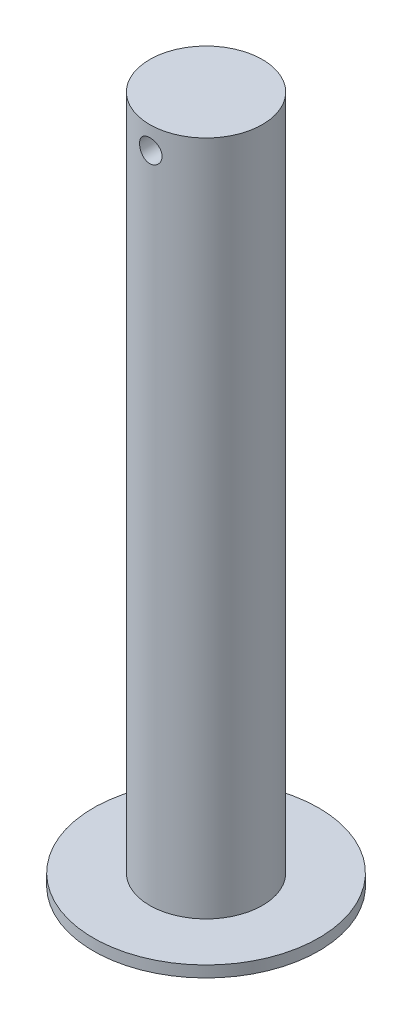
ISO-10303-21;
HEADER;
FILE_DESCRIPTION(('STEP AP214'),'2;1');
FILE_NAME('part.step','',(''),(''),'','','');
FILE_SCHEMA(('AUTOMOTIVE_DESIGN { 1 0 10303 214 1 1 1 1 }'));
ENDSEC;
DATA;
#1=APPLICATION_CONTEXT('core data for automotive mechanical design processes');
#2=APPLICATION_PROTOCOL_DEFINITION('international standard','automotive_design',2000,#1);
#3=PRODUCT_CONTEXT('',#1,'mechanical');
#4=PRODUCT('Part','Part','',(#3));
#5=PRODUCT_RELATED_PRODUCT_CATEGORY('part','',(#4));
#6=PRODUCT_DEFINITION_FORMATION('','',#4);
#7=PRODUCT_DEFINITION_CONTEXT('part definition',#1,'design');
#8=PRODUCT_DEFINITION('design','',#6,#7);
#9=PRODUCT_DEFINITION_SHAPE('','',#8);
#10=(LENGTH_UNIT() NAMED_UNIT(*) SI_UNIT(.MILLI.,.METRE.));
#11=(NAMED_UNIT(*) PLANE_ANGLE_UNIT() SI_UNIT($,.RADIAN.));
#12=(NAMED_UNIT(*) SI_UNIT($,.STERADIAN.) SOLID_ANGLE_UNIT());
#13=UNCERTAINTY_MEASURE_WITH_UNIT(LENGTH_MEASURE(1.E-05),#10,'distance_accuracy_value','');
#14=(GEOMETRIC_REPRESENTATION_CONTEXT(3) GLOBAL_UNCERTAINTY_ASSIGNED_CONTEXT((#13)) GLOBAL_UNIT_ASSIGNED_CONTEXT((#10,
#11,#12)) REPRESENTATION_CONTEXT('',''));
#15=CARTESIAN_POINT('',(0.,0.,0.));
#16=DIRECTION('',(0.,0.,1.));
#17=DIRECTION('',(1.,0.,0.));
#18=AXIS2_PLACEMENT_3D('',#15,#16,#17);
#19=CARTESIAN_POINT('',(0.,-1.27,0.));
#20=DIRECTION('',(0.,-1.,0.));
#21=DIRECTION('',(0.,0.,-1.));
#22=AXIS2_PLACEMENT_3D('',#19,#20,#21);
#23=CONICAL_SURFACE('',#22,10.31875,0.785398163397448);
#24=CARTESIAN_POINT('',(0.,0.,0.));
#25=DIRECTION('',(0.,1.,0.));
#26=DIRECTION('',(0.,0.,1.));
#27=AXIS2_PLACEMENT_3D('',#24,#25,#26);
#28=CIRCLE('',#27,9.04875000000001);
#29=CARTESIAN_POINT('',(0.,0.,9.04875000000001));
#30=VERTEX_POINT('',#29);
#31=EDGE_CURVE('E45',#30,#30,#28,.F.);
#32=ORIENTED_EDGE('',*,*,#31,.F.);
#33=EDGE_LOOP('',(#32));
#34=FACE_BOUND('',#33,.T.);
#35=CARTESIAN_POINT('',(0.,-1.27,0.));
#36=DIRECTION('',(0.,-1.,0.));
#37=DIRECTION('',(0.,0.,-1.));
#38=AXIS2_PLACEMENT_3D('',#35,#36,#37);
#39=CIRCLE('',#38,10.31875);
#40=CARTESIAN_POINT('',(0.,-1.27,-10.31875));
#41=VERTEX_POINT('',#40);
#42=EDGE_CURVE('E11',#41,#41,#39,.T.);
#43=ORIENTED_EDGE('',*,*,#42,.T.);
#44=EDGE_LOOP('',(#43));
#45=FACE_BOUND('',#44,.T.);
#46=ADVANCED_FACE('F39',(#34,#45),#23,.F.);
#47=CARTESIAN_POINT('',(0.,-2.54,0.));
#48=DIRECTION('',(0.,1.,0.));
#49=DIRECTION('',(0.,0.,1.));
#50=AXIS2_PLACEMENT_3D('',#47,#48,#49);
#51=CYLINDRICAL_SURFACE('',#50,10.31875);
#52=CARTESIAN_POINT('',(0.,0.,0.));
#53=DIRECTION('',(0.,1.,0.));
#54=DIRECTION('',(0.,0.,1.));
#55=AXIS2_PLACEMENT_3D('',#52,#53,#54);
#56=CIRCLE('',#55,10.31875);
#57=CARTESIAN_POINT('',(0.,0.,10.31875));
#58=VERTEX_POINT('',#57);
#59=EDGE_CURVE('E49',#58,#58,#56,.T.);
#60=ORIENTED_EDGE('',*,*,#59,.F.);
#61=EDGE_LOOP('',(#60));
#62=FACE_BOUND('',#61,.T.);
#63=ORIENTED_EDGE('',*,*,#42,.F.);
#64=EDGE_LOOP('',(#63));
#65=FACE_BOUND('',#64,.T.);
#66=ADVANCED_FACE('F58',(#62,#65),#51,.T.);
#67=CARTESIAN_POINT('',(0.,0.,0.));
#68=DIRECTION('',(0.,1.,0.));
#69=DIRECTION('',(0.,0.,1.));
#70=AXIS2_PLACEMENT_3D('',#67,#68,#69);
#71=PLANE('',#70);
#72=ORIENTED_EDGE('',*,*,#59,.T.);
#73=EDGE_LOOP('',(#72));
#74=FACE_BOUND('',#73,.T.);
#75=ORIENTED_EDGE('',*,*,#31,.T.);
#76=EDGE_LOOP('',(#75));
#77=FACE_BOUND('',#76,.T.);
#78=ADVANCED_FACE('F56',(#74,#77),#71,.T.);
#79=CLOSED_SHELL('',(#46,#66,#78));
#80=MANIFOLD_SOLID_BREP('B2',#79);
#81=CARTESIAN_POINT('',(0.,-2.54,0.));
#82=DIRECTION('',(0.,-1.,0.));
#83=DIRECTION('',(0.,0.,-1.));
#84=AXIS2_PLACEMENT_3D('',#81,#82,#83);
#85=PLANE('',#84);
#86=CARTESIAN_POINT('',(0.,-2.54,0.));
#87=DIRECTION('',(0.,-1.,0.));
#88=DIRECTION('',(0.,0.,-1.));
#89=AXIS2_PLACEMENT_3D('',#86,#87,#88);
#90=CIRCLE('',#89,25.4);
#91=CARTESIAN_POINT('',(0.,-2.54,-25.4));
#92=VERTEX_POINT('',#91);
#93=EDGE_CURVE('E38',#92,#92,#90,.T.);
#94=ORIENTED_EDGE('',*,*,#93,.T.);
#95=EDGE_LOOP('',(#94));
#96=FACE_BOUND('',#95,.T.);
#97=CARTESIAN_POINT('',(0.,-2.54,0.));
#98=DIRECTION('',(0.,-1.,0.));
#99=DIRECTION('',(0.,0.,-1.));
#100=AXIS2_PLACEMENT_3D('',#97,#98,#99);
#101=CIRCLE('',#100,10.31875);
#102=CARTESIAN_POINT('',(0.,-2.54,-10.31875));
#103=VERTEX_POINT('',#102);
#104=EDGE_CURVE('E103',#103,#103,#101,.T.);
#105=ORIENTED_EDGE('',*,*,#104,.F.);
#106=EDGE_LOOP('',(#105));
#107=FACE_BOUND('',#106,.T.);
#108=ADVANCED_FACE('F92',(#96,#107),#85,.T.);
#109=CARTESIAN_POINT('',(0.,0.,0.));
#110=DIRECTION('',(0.,-1.,0.));
#111=DIRECTION('',(0.,0.,-1.));
#112=AXIS2_PLACEMENT_3D('',#109,#110,#111);
#113=PLANE('',#112);
#114=CARTESIAN_POINT('',(0.,0.,0.));
#115=DIRECTION('',(0.,-1.,0.));
#116=DIRECTION('',(0.,0.,-1.));
#117=AXIS2_PLACEMENT_3D('',#114,#115,#116);
#118=CIRCLE('',#117,25.4);
#119=CARTESIAN_POINT('',(0.,0.,-25.4));
#120=VERTEX_POINT('',#119);
#121=EDGE_CURVE('E96',#120,#120,#118,.T.);
#122=ORIENTED_EDGE('',*,*,#121,.F.);
#123=EDGE_LOOP('',(#122));
#124=FACE_BOUND('',#123,.T.);
#125=CARTESIAN_POINT('',(0.,0.,0.));
#126=DIRECTION('',(0.,-1.,0.));
#127=DIRECTION('',(0.,0.,-1.));
#128=AXIS2_PLACEMENT_3D('',#125,#126,#127);
#129=CIRCLE('',#128,10.31875);
#130=CARTESIAN_POINT('',(0.,0.,-10.31875));
#131=VERTEX_POINT('',#130);
#132=EDGE_CURVE('E105',#131,#131,#129,.T.);
#133=ORIENTED_EDGE('',*,*,#132,.T.);
#134=EDGE_LOOP('',(#133));
#135=FACE_BOUND('',#134,.T.);
#136=ADVANCED_FACE('F115',(#124,#135),#113,.F.);
#137=CARTESIAN_POINT('',(0.,-2.54,0.));
#138=DIRECTION('',(0.,1.,0.));
#139=DIRECTION('',(0.,0.,1.));
#140=AXIS2_PLACEMENT_3D('',#137,#138,#139);
#141=CYLINDRICAL_SURFACE('',#140,25.4);
#142=ORIENTED_EDGE('',*,*,#93,.F.);
#143=EDGE_LOOP('',(#142));
#144=FACE_BOUND('',#143,.T.);
#145=ORIENTED_EDGE('',*,*,#121,.T.);
#146=EDGE_LOOP('',(#145));
#147=FACE_BOUND('',#146,.T.);
#148=ADVANCED_FACE('F94',(#144,#147),#141,.T.);
#149=CARTESIAN_POINT('',(0.,-2.54,0.));
#150=DIRECTION('',(0.,1.,0.));
#151=DIRECTION('',(0.,0.,1.));
#152=AXIS2_PLACEMENT_3D('',#149,#150,#151);
#153=CYLINDRICAL_SURFACE('',#152,10.31875);
#154=ORIENTED_EDGE('',*,*,#104,.T.);
#155=EDGE_LOOP('',(#154));
#156=FACE_BOUND('',#155,.T.);
#157=ORIENTED_EDGE('',*,*,#132,.F.);
#158=EDGE_LOOP('',(#157));
#159=FACE_BOUND('',#158,.T.);
#160=ADVANCED_FACE('F111',(#156,#159),#153,.F.);
#161=CLOSED_SHELL('',(#108,#136,#148,#160));
#162=MANIFOLD_SOLID_BREP('B6',#161);
#163=CARTESIAN_POINT('',(0.,152.4,0.));
#164=DIRECTION('',(0.,-1.,0.));
#165=DIRECTION('',(0.,0.,-1.));
#166=AXIS2_PLACEMENT_3D('',#163,#164,#165);
#167=CYLINDRICAL_SURFACE('',#166,12.7);
#168=CARTESIAN_POINT('',(0.,149.86,-12.7));
#169=CARTESIAN_POINT('',(-0.14116534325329,149.859994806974,-12.6999973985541));
#170=CARTESIAN_POINT('',(-0.282396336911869,149.848191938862,-12.6976221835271));
#171=CARTESIAN_POINT('',(-0.560866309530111,149.801329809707,-12.6883760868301));
#172=CARTESIAN_POINT('',(-0.698102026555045,149.766252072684,-12.6815016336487));
#173=CARTESIAN_POINT('',(-0.96451497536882,149.673967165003,-12.6640246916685));
#174=CARTESIAN_POINT('',(-1.09369978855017,149.616781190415,-12.6534257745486));
#175=CARTESIAN_POINT('',(-1.34063229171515,149.481966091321,-12.629652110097));
#176=CARTESIAN_POINT('',(-1.45838066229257,149.404338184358,-12.616477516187));
#177=CARTESIAN_POINT('',(-1.68070143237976,149.2297282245,-12.5888029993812));
#178=CARTESIAN_POINT('',(-1.78509663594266,149.132522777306,-12.5742889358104));
#179=CARTESIAN_POINT('',(-1.9762133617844,148.921997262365,-12.5456741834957));
#180=CARTESIAN_POINT('',(-2.06293350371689,148.808675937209,-12.5315735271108));
#181=CARTESIAN_POINT('',(-2.21699265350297,148.56786086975,-12.5052440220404));
#182=CARTESIAN_POINT('',(-2.28414818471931,148.440247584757,-12.4930333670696));
#183=CARTESIAN_POINT('',(-2.39599639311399,148.17526417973,-12.4720672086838));
#184=CARTESIAN_POINT('',(-2.44069128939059,148.0378950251,-12.4633113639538));
#185=CARTESIAN_POINT('',(-2.50577426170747,147.759205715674,-12.450389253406));
#186=CARTESIAN_POINT('',(-2.52647322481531,147.617960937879,-12.4461643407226));
#187=CARTESIAN_POINT('',(-2.54394240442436,147.333945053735,-12.4426059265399));
#188=CARTESIAN_POINT('',(-2.54071506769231,147.191174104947,-12.4432719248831));
#189=CARTESIAN_POINT('',(-2.51067461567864,146.910433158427,-12.4493667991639));
#190=CARTESIAN_POINT('',(-2.48421789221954,146.772423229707,-12.4547237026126));
#191=CARTESIAN_POINT('',(-2.40903222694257,146.502841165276,-12.469483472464));
#192=CARTESIAN_POINT('',(-2.36030222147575,146.371269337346,-12.4788865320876));
#193=CARTESIAN_POINT('',(-2.2416129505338,146.117271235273,-12.5007527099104));
#194=CARTESIAN_POINT('',(-2.17151242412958,145.994912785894,-12.5132360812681));
#195=CARTESIAN_POINT('',(-2.01217167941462,145.763562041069,-12.5398433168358));
#196=CARTESIAN_POINT('',(-1.92292926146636,145.654571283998,-12.5539673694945));
#197=CARTESIAN_POINT('',(-1.7259298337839,145.450993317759,-12.5825763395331));
#198=CARTESIAN_POINT('',(-1.61786864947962,145.356700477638,-12.597063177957));
#199=CARTESIAN_POINT('',(-1.38730996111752,145.187533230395,-12.624532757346));
#200=CARTESIAN_POINT('',(-1.26481227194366,145.112659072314,-12.6375154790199));
#201=CARTESIAN_POINT('',(-1.00853084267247,144.984400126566,-12.6605459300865));
#202=CARTESIAN_POINT('',(-0.874729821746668,144.931048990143,-12.6705890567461));
#203=CARTESIAN_POINT('',(-0.599818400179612,144.847664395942,-12.6865737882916));
#204=CARTESIAN_POINT('',(-0.458708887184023,144.817628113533,-12.6925158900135));
#205=CARTESIAN_POINT('',(-0.175715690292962,144.782142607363,-12.6995598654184));
#206=CARTESIAN_POINT('',(-0.0338844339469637,144.776290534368,-12.7007410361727));
#207=CARTESIAN_POINT('',(0.248729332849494,144.788254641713,-12.6983503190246));
#208=CARTESIAN_POINT('',(0.389511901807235,144.806069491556,-12.6947786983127));
#209=CARTESIAN_POINT('',(0.664732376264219,144.864527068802,-12.6833333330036));
#210=CARTESIAN_POINT('',(0.799215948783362,144.904963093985,-12.6754985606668));
#211=CARTESIAN_POINT('',(1.05949401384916,145.007289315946,-12.6564022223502));
#212=CARTESIAN_POINT('',(1.18528785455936,145.069181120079,-12.6451403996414));
#213=CARTESIAN_POINT('',(1.426314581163,145.213533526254,-12.6202417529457));
#214=CARTESIAN_POINT('',(1.54139932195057,145.296236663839,-12.6065775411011));
#215=CARTESIAN_POINT('',(1.7562017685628,145.479539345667,-12.578454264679));
#216=CARTESIAN_POINT('',(1.85591782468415,145.580140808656,-12.5639951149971));
#217=CARTESIAN_POINT('',(2.03870710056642,145.798218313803,-12.5356443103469));
#218=CARTESIAN_POINT('',(2.12150376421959,145.915927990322,-12.5217646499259));
#219=CARTESIAN_POINT('',(2.26615096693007,146.163820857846,-12.4963984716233));
#220=CARTESIAN_POINT('',(2.32800234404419,146.294003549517,-12.4849118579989));
#221=CARTESIAN_POINT('',(2.4286256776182,146.56249134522,-12.4657292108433));
#222=CARTESIAN_POINT('',(2.46751728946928,146.700750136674,-12.4580135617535));
#223=CARTESIAN_POINT('',(2.52147997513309,146.982010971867,-12.4472048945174));
#224=CARTESIAN_POINT('',(2.5365541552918,147.125012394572,-12.4441112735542));
#225=CARTESIAN_POINT('',(2.54233911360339,147.408922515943,-12.442930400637));
#226=CARTESIAN_POINT('',(2.53348690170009,147.549822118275,-12.4447533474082));
#227=CARTESIAN_POINT('',(2.49263485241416,147.828080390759,-12.4529995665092));
#228=CARTESIAN_POINT('',(2.46063520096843,147.965439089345,-12.4594228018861));
#229=CARTESIAN_POINT('',(2.37459156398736,148.232438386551,-12.4761057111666));
#230=CARTESIAN_POINT('',(2.32060116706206,148.362096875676,-12.4863560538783));
#231=CARTESIAN_POINT('',(2.19215879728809,148.610583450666,-12.5095435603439));
#232=CARTESIAN_POINT('',(2.11770510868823,148.729410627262,-12.5224809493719));
#233=CARTESIAN_POINT('',(1.94895702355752,148.955037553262,-12.5498595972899));
#234=CARTESIAN_POINT('',(1.85434703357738,149.06159866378,-12.5643226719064));
#235=CARTESIAN_POINT('',(1.6486234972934,149.257476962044,-12.5929664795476));
#236=CARTESIAN_POINT('',(1.53750616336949,149.346790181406,-12.6071471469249));
#237=CARTESIAN_POINT('',(1.30052477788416,149.506519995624,-12.6338033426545));
#238=CARTESIAN_POINT('',(1.1745185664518,149.576729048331,-12.6462594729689));
#239=CARTESIAN_POINT('',(0.912282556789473,149.694864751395,-12.667872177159));
#240=CARTESIAN_POINT('',(0.77606210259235,149.742811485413,-12.6770317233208));
#241=CARTESIAN_POINT('',(0.53294658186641,149.805775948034,-12.6892398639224));
#242=CARTESIAN_POINT('',(0.427435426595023,149.826073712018,-12.6932513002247));
#243=CARTESIAN_POINT('',(0.214628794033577,149.85318749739,-12.6986323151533));
#244=CARTESIAN_POINT('',(0.107333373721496,149.860003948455,-12.7000019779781));
#245=CARTESIAN_POINT('',(0.,149.86,-12.7));
#246=B_SPLINE_CURVE_WITH_KNOTS('',3,(#168,#169,#170,#171,#172,#173,#174,#175,#176,#177,#178,
#179,#180,#181,#182,#183,#184,#185,#186,#187,#188,#189,#190,#191,#192,#193,#194,#195,#196,#197,
#198,#199,#200,#201,#202,#203,#204,#205,#206,#207,#208,#209,#210,#211,#212,#213,#214,#215,#216,
#217,#218,#219,#220,#221,#222,#223,#224,#225,#226,#227,#228,#229,#230,#231,#232,#233,#234,#235,
#236,#237,#238,#239,#240,#241,#242,#243,#244,#245),.UNSPECIFIED.,.T.,.F.,(4,2,2,2,2,2,2,2,2,2,2,
2,2,2,2,2,2,2,2,2,2,2,2,2,2,2,2,2,2,2,2,2,2,2,2,2,2,2,4),(0.,0.423103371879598,
0.846543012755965,1.26957768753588,1.69258717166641,2.12072898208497,2.54890421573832,
2.98097435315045,3.41300179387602,3.83936710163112,4.26568880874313,4.68558186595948,
5.10549497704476,5.52824625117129,5.95104613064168,6.38145161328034,6.81186261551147,
7.24294398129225,7.67397311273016,8.09779268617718,8.52158843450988,8.94157353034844,
9.36159009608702,9.78674867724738,10.2119528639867,10.6436319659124,11.0752937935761,
11.5046856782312,11.9340215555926,12.3555689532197,12.7771129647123,13.1976358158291,
13.6181939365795,14.0458971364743,14.4736986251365,14.9059772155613,15.3378650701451,
15.6595768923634,15.9812784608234),.UNSPECIFIED.);
#247=CARTESIAN_POINT('',(0.,149.86,-12.7));
#248=VERTEX_POINT('',#247);
#249=EDGE_CURVE('E91',#248,#248,#246,.T.);
#250=ORIENTED_EDGE('',*,*,#249,.T.);
#251=EDGE_LOOP('',(#250));
#252=FACE_BOUND('',#251,.T.);
#253=CARTESIAN_POINT('',(2.54000000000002,147.32,12.4434078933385));
#254=CARTESIAN_POINT('',(2.5399947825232,147.178866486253,12.4434106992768));
#255=CARTESIAN_POINT('',(2.5281970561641,147.037667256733,12.445835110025));
#256=CARTESIAN_POINT('',(2.48135720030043,146.759263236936,12.4552565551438));
#257=CARTESIAN_POINT('',(2.44629647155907,146.622061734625,12.4622572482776));
#258=CARTESIAN_POINT('',(2.35406128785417,146.35572124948,12.4800073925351));
#259=CARTESIAN_POINT('',(2.29690882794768,146.226574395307,12.4907531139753));
#260=CARTESIAN_POINT('',(2.16217273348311,145.97970589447,12.5147781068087));
#261=CARTESIAN_POINT('',(2.08459023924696,145.861983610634,12.5280572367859));
#262=CARTESIAN_POINT('',(1.91002685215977,145.639635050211,12.555862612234));
#263=CARTESIAN_POINT('',(1.81281236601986,145.535193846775,12.5704025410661));
#264=CARTESIAN_POINT('',(1.60224924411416,145.343987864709,12.598970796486));
#265=CARTESIAN_POINT('',(1.48889947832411,145.25722432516,12.6129990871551));
#266=CARTESIAN_POINT('',(1.24805784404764,145.103118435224,12.6391110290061));
#267=CARTESIAN_POINT('',(1.12045132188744,145.035951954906,12.6511766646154));
#268=CARTESIAN_POINT('',(0.855482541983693,144.924081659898,12.6718501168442));
#269=CARTESIAN_POINT('',(0.718121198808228,144.879375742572,12.6804582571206));
#270=CARTESIAN_POINT('',(0.439462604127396,144.814271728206,12.6931501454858));
#271=CARTESIAN_POINT('',(0.298241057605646,144.79356111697,12.6972920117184));
#272=CARTESIAN_POINT('',(0.0142711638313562,144.776060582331,12.7007853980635));
#273=CARTESIAN_POINT('',(-0.128477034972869,144.7792683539,12.7001373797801));
#274=CARTESIAN_POINT('',(-0.409300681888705,144.809276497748,12.6941690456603));
#275=CARTESIAN_POINT('',(-0.547413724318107,144.835740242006,12.6889153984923));
#276=CARTESIAN_POINT('',(-0.817198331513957,144.910975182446,12.674401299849));
#277=CARTESIAN_POINT('',(-0.948869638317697,144.959747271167,12.6651406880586));
#278=CARTESIAN_POINT('',(-1.20299343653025,145.078526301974,12.6435433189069));
#279=CARTESIAN_POINT('',(-1.3253826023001,145.148665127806,12.6311875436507));
#280=CARTESIAN_POINT('',(-1.55677881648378,145.308089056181,12.6047619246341));
#281=CARTESIAN_POINT('',(-1.6657843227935,145.397376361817,12.5906918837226));
#282=CARTESIAN_POINT('',(-1.86931663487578,145.594409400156,12.5621024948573));
#283=CARTESIAN_POINT('',(-1.96355796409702,145.702449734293,12.5475795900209));
#284=CARTESIAN_POINT('',(-2.13263097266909,145.932947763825,12.5199539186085));
#285=CARTESIAN_POINT('',(-2.20746228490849,146.055405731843,12.5068511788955));
#286=CARTESIAN_POINT('',(-2.33568954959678,146.311672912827,12.4835424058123));
#287=CARTESIAN_POINT('',(-2.38903928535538,146.445505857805,12.4733426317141));
#288=CARTESIAN_POINT('',(-2.47241146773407,146.720487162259,12.4570864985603));
#289=CARTESIAN_POINT('',(-2.50243695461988,146.861634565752,12.4510295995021));
#290=CARTESIAN_POINT('',(-2.53788165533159,147.144650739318,12.4438531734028));
#291=CARTESIAN_POINT('',(-2.54371312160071,147.286465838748,12.4426509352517));
#292=CARTESIAN_POINT('',(-2.53171357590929,147.569042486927,12.4450979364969));
#293=CARTESIAN_POINT('',(-2.51388390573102,147.709804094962,12.4487469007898));
#294=CARTESIAN_POINT('',(-2.45542360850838,147.984892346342,12.4604077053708));
#295=CARTESIAN_POINT('',(-2.41501325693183,148.119267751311,12.4683773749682));
#296=CARTESIAN_POINT('',(-2.31277422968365,148.379340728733,12.4877446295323));
#297=CARTESIAN_POINT('',(-2.25094378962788,148.505037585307,12.4991424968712));
#298=CARTESIAN_POINT('',(-2.10668652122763,148.745989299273,12.5242677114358));
#299=CARTESIAN_POINT('',(-2.0240017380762,148.861086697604,12.5380234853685));
#300=CARTESIAN_POINT('',(-1.8407267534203,149.075923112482,12.5662365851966));
#301=CARTESIAN_POINT('',(-1.74013470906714,149.175660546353,12.580693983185));
#302=CARTESIAN_POINT('',(-1.52204997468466,149.358508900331,12.6089497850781));
#303=CARTESIAN_POINT('',(-1.40432154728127,149.441341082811,12.6227346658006));
#304=CARTESIAN_POINT('',(-1.15638045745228,149.586050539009,12.6478570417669));
#305=CARTESIAN_POINT('',(-1.02616831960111,149.647928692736,12.6591946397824));
#306=CARTESIAN_POINT('',(-0.757688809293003,149.748567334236,12.6780872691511));
#307=CARTESIAN_POINT('',(-0.619472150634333,149.787458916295,12.6856637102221));
#308=CARTESIAN_POINT('',(-0.338301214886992,149.841435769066,12.6962721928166));
#309=CARTESIAN_POINT('',(-0.195347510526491,149.856523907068,12.6993047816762));
#310=CARTESIAN_POINT('',(0.0885771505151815,149.862354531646,12.7004709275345));
#311=CARTESIAN_POINT('',(0.229539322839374,149.853516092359,12.698688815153));
#312=CARTESIAN_POINT('',(0.507926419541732,149.812669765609,12.6906031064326));
#313=CARTESIAN_POINT('',(0.645351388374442,149.780662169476,12.6842995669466));
#314=CARTESIAN_POINT('',(0.912501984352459,149.694572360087,12.667881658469));
#315=CARTESIAN_POINT('',(1.04224440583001,149.640540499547,12.6577759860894));
#316=CARTESIAN_POINT('',(1.29088189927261,149.511988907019,12.6348419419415));
#317=CARTESIAN_POINT('',(1.40977611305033,149.437467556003,12.6220133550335));
#318=CARTESIAN_POINT('',(1.63541428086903,149.268638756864,12.5947830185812));
#319=CARTESIAN_POINT('',(1.7419312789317,149.174031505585,12.5803592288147));
#320=CARTESIAN_POINT('',(1.9377218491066,148.968332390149,12.5516950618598));
#321=CARTESIAN_POINT('',(2.02699133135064,148.857236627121,12.5374547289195));
#322=CARTESIAN_POINT('',(2.18666623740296,148.620278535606,12.5106009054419));
#323=CARTESIAN_POINT('',(2.25685810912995,148.494270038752,12.4980065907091));
#324=CARTESIAN_POINT('',(2.37496108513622,148.232030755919,12.4761050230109));
#325=CARTESIAN_POINT('',(2.42289240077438,148.095809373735,12.4667947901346));
#326=CARTESIAN_POINT('',(2.48581961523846,147.852733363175,12.4543739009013));
#327=CARTESIAN_POINT('',(2.50610090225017,147.747265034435,12.450287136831));
#328=CARTESIAN_POINT('',(2.53319284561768,147.53454375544,12.4448031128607));
#329=CARTESIAN_POINT('',(2.54000396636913,147.427290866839,12.443405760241));
#330=CARTESIAN_POINT('',(2.54000000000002,147.32,12.4434078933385));
#331=B_SPLINE_CURVE_WITH_KNOTS('',3,(#253,#254,#255,#256,#257,#258,#259,#260,#261,#262,#263,
#264,#265,#266,#267,#268,#269,#270,#271,#272,#273,#274,#275,#276,#277,#278,#279,#280,#281,#282,
#283,#284,#285,#286,#287,#288,#289,#290,#291,#292,#293,#294,#295,#296,#297,#298,#299,#300,#301,
#302,#303,#304,#305,#306,#307,#308,#309,#310,#311,#312,#313,#314,#315,#316,#317,#318,#319,#320,
#321,#322,#323,#324,#325,#326,#327,#328,#329,#330),.UNSPECIFIED.,.T.,.F.,(4,2,2,2,2,2,2,2,2,2,2,
2,2,2,2,2,2,2,2,2,2,2,2,2,2,2,2,2,2,2,2,2,2,2,2,2,2,2,4),(0.,0.423007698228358,
0.846354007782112,1.26927990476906,1.69218220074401,2.12044921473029,2.54874623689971,
2.98077637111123,3.41276605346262,3.83906392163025,4.26532070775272,4.68550725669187,
5.10571061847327,5.52856207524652,5.95146220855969,6.38173340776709,6.81201274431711,
7.24321292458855,7.67435688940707,8.09812344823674,8.52186597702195,8.94154528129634,
9.36125916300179,9.78644371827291,10.2116720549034,10.6434280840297,11.0751659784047,
11.5044172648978,11.9336168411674,12.3553478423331,12.7770735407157,13.1978404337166,
13.618640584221,14.0462292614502,14.4739192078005,14.9062160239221,15.3381195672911,
15.6597046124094,15.9812785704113),.UNSPECIFIED.);
#332=CARTESIAN_POINT('',(2.54000000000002,147.32,12.4434078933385));
#333=VERTEX_POINT('',#332);
#334=EDGE_CURVE('E163',#333,#333,#331,.T.);
#335=ORIENTED_EDGE('',*,*,#334,.T.);
#336=EDGE_LOOP('',(#335));
#337=FACE_BOUND('',#336,.T.);
#338=CARTESIAN_POINT('',(0.,152.4,0.));
#339=DIRECTION('',(0.,1.,0.));
#340=DIRECTION('',(0.,0.,1.));
#341=AXIS2_PLACEMENT_3D('',#338,#339,#340);
#342=CIRCLE('',#341,12.7);
#343=CARTESIAN_POINT('',(0.,152.4,12.7));
#344=VERTEX_POINT('',#343);
#345=EDGE_CURVE('E167',#344,#344,#342,.T.);
#346=ORIENTED_EDGE('',*,*,#345,.F.);
#347=EDGE_LOOP('',(#346));
#348=FACE_BOUND('',#347,.T.);
#349=CARTESIAN_POINT('',(0.,0.,0.));
#350=DIRECTION('',(0.,1.,0.));
#351=DIRECTION('',(0.,0.,1.));
#352=AXIS2_PLACEMENT_3D('',#349,#350,#351);
#353=CIRCLE('',#352,12.7);
#354=CARTESIAN_POINT('',(0.,0.,12.7));
#355=VERTEX_POINT('',#354);
#356=EDGE_CURVE('E171',#355,#355,#353,.T.);
#357=ORIENTED_EDGE('',*,*,#356,.T.);
#358=EDGE_LOOP('',(#357));
#359=FACE_BOUND('',#358,.T.);
#360=ADVANCED_FACE('F153',(#252,#337,#348,#359),#167,.T.);
#361=CARTESIAN_POINT('',(0.,152.4,0.));
#362=DIRECTION('',(0.,1.,0.));
#363=DIRECTION('',(0.,0.,1.));
#364=AXIS2_PLACEMENT_3D('',#361,#362,#363);
#365=PLANE('',#364);
#366=ORIENTED_EDGE('',*,*,#345,.T.);
#367=EDGE_LOOP('',(#366));
#368=FACE_BOUND('',#367,.T.);
#369=ADVANCED_FACE('F182',(#368),#365,.T.);
#370=CARTESIAN_POINT('',(0.,0.,0.));
#371=DIRECTION('',(0.,1.,0.));
#372=DIRECTION('',(0.,0.,1.));
#373=AXIS2_PLACEMENT_3D('',#370,#371,#372);
#374=PLANE('',#373);
#375=ORIENTED_EDGE('',*,*,#356,.F.);
#376=EDGE_LOOP('',(#375));
#377=FACE_BOUND('',#376,.T.);
#378=ADVANCED_FACE('F180',(#377),#374,.F.);
#379=CARTESIAN_POINT('',(0.,147.32,-12.7));
#380=DIRECTION('',(0.,0.,1.));
#381=DIRECTION('',(1.,0.,0.));
#382=AXIS2_PLACEMENT_3D('',#379,#380,#381);
#383=CYLINDRICAL_SURFACE('',#382,2.54000000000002);
#384=ORIENTED_EDGE('',*,*,#334,.F.);
#385=EDGE_LOOP('',(#384));
#386=FACE_BOUND('',#385,.T.);
#387=ORIENTED_EDGE('',*,*,#249,.F.);
#388=EDGE_LOOP('',(#387));
#389=FACE_BOUND('',#388,.T.);
#390=ADVANCED_FACE('F176',(#386,#389),#383,.F.);
#391=CLOSED_SHELL('',(#360,#369,#378,#390));
#392=MANIFOLD_SOLID_BREP('B33',#391);
#393=ADVANCED_BREP_SHAPE_REPRESENTATION('',(#18,#80,#162,#392),#14);
#394=SHAPE_DEFINITION_REPRESENTATION(#9,#393);
ENDSEC;
END-ISO-10303-21;
